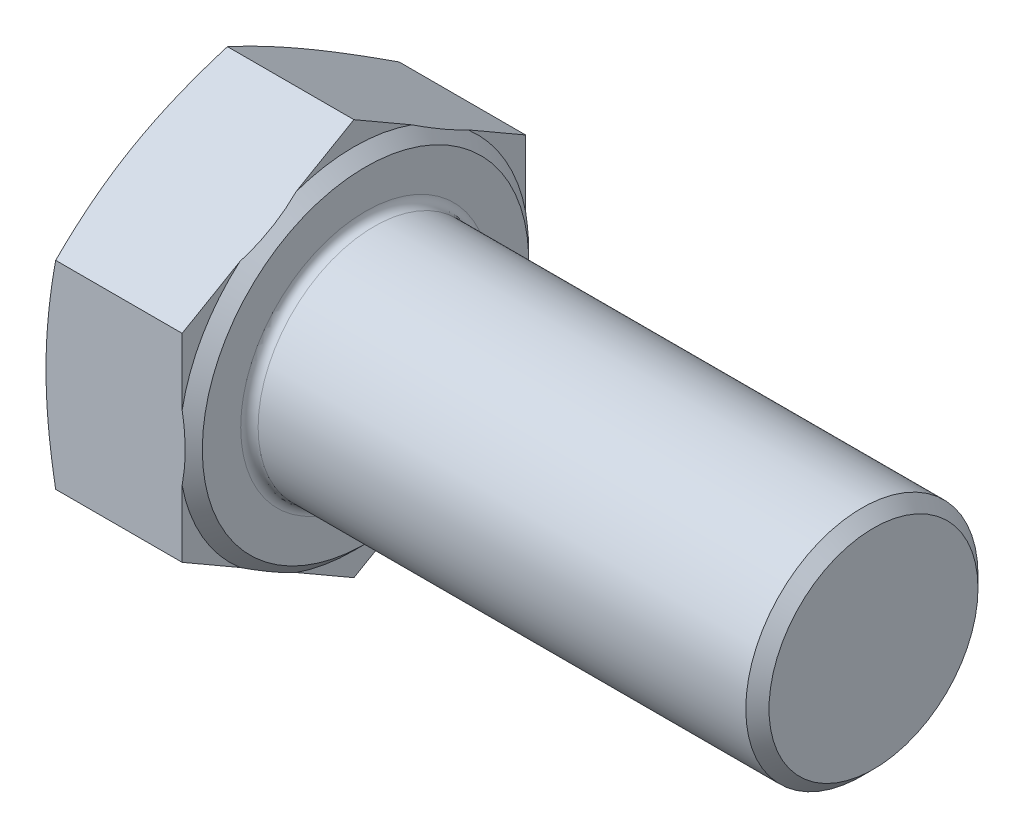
ISO-10303-21;
HEADER;
FILE_DESCRIPTION(('STEP AP214'),'2;1');
FILE_NAME('part.step','',(''),(''),'','','');
FILE_SCHEMA(('AUTOMOTIVE_DESIGN { 1 0 10303 214 1 1 1 1 }'));
ENDSEC;
DATA;
#1=APPLICATION_CONTEXT('core data for automotive mechanical design processes');
#2=APPLICATION_PROTOCOL_DEFINITION('international standard','automotive_design',2000,#1);
#3=PRODUCT_CONTEXT('',#1,'mechanical');
#4=PRODUCT('Part','Part','',(#3));
#5=PRODUCT_RELATED_PRODUCT_CATEGORY('part','',(#4));
#6=PRODUCT_DEFINITION_FORMATION('','',#4);
#7=PRODUCT_DEFINITION_CONTEXT('part definition',#1,'design');
#8=PRODUCT_DEFINITION('design','',#6,#7);
#9=PRODUCT_DEFINITION_SHAPE('','',#8);
#10=(LENGTH_UNIT() NAMED_UNIT(*) SI_UNIT(.MILLI.,.METRE.));
#11=(NAMED_UNIT(*) PLANE_ANGLE_UNIT() SI_UNIT($,.RADIAN.));
#12=(NAMED_UNIT(*) SI_UNIT($,.STERADIAN.) SOLID_ANGLE_UNIT());
#13=UNCERTAINTY_MEASURE_WITH_UNIT(LENGTH_MEASURE(1.E-05),#10,'distance_accuracy_value','');
#14=(GEOMETRIC_REPRESENTATION_CONTEXT(3) GLOBAL_UNCERTAINTY_ASSIGNED_CONTEXT((#13)) GLOBAL_UNIT_ASSIGNED_CONTEXT((#10,
#11,#12)) REPRESENTATION_CONTEXT('',''));
#15=CARTESIAN_POINT('',(0.,0.,0.));
#16=DIRECTION('',(0.,0.,1.));
#17=DIRECTION('',(1.,0.,0.));
#18=AXIS2_PLACEMENT_3D('',#15,#16,#17);
#19=CARTESIAN_POINT('',(10.18,-6.83294043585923,-11.835));
#20=DIRECTION('',(1.,0.,0.));
#21=DIRECTION('',(0.,0.,-1.));
#22=AXIS2_PLACEMENT_3D('',#19,#20,#21);
#23=PLANE('',#22);
#24=CARTESIAN_POINT('',(10.18,0.,0.));
#25=DIRECTION('',(1.,0.,0.));
#26=DIRECTION('',(0.,0.,-1.));
#27=AXIS2_PLACEMENT_3D('',#24,#25,#26);
#28=CIRCLE('',#27,8.6);
#29=CARTESIAN_POINT('',(10.18,0.,-8.6));
#30=VERTEX_POINT('',#29);
#31=EDGE_CURVE('E11',#30,#30,#28,.F.);
#32=ORIENTED_EDGE('',*,*,#31,.T.);
#33=EDGE_LOOP('',(#32));
#34=FACE_BOUND('',#33,.T.);
#35=CARTESIAN_POINT('',(10.18,0.,0.));
#36=DIRECTION('',(-1.,0.,0.));
#37=DIRECTION('',(0.,0.,1.));
#38=AXIS2_PLACEMENT_3D('',#35,#36,#37);
#39=CIRCLE('',#38,11.245);
#40=CARTESIAN_POINT('',(10.18,0.,11.245));
#41=VERTEX_POINT('',#40);
#42=EDGE_CURVE('E572',#41,#41,#39,.T.);
#43=ORIENTED_EDGE('',*,*,#42,.F.);
#44=EDGE_LOOP('',(#43));
#45=FACE_BOUND('',#44,.T.);
#46=ADVANCED_FACE('F34',(#34,#45),#23,.T.);
#47=CARTESIAN_POINT('',(10.18,-13.6658808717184,0.));
#48=DIRECTION('',(0.,0.866025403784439,0.5));
#49=DIRECTION('',(0.,-0.5,0.866025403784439));
#50=AXIS2_PLACEMENT_3D('',#47,#48,#49);
#51=PLANE('',#50);
#52=CARTESIAN_POINT('',(0.66642816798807,-6.83282496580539,-11.8352));
#53=CARTESIAN_POINT('',(0.563396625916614,-7.11580158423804,-11.3450701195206));
#54=CARTESIAN_POINT('',(0.469671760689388,-7.39971131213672,-10.8533240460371));
#55=CARTESIAN_POINT('',(0.304777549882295,-7.96937670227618,-9.86663464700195));
#56=CARTESIAN_POINT('',(0.233625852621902,-8.25513363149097,-9.37168912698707));
#57=CARTESIAN_POINT('',(0.118540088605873,-8.82532231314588,-8.38409336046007));
#58=CARTESIAN_POINT('',(0.0743550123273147,-9.10974104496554,-7.8914656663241));
#59=CARTESIAN_POINT('',(0.0150904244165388,-9.67924359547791,-6.90505831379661));
#60=CARTESIAN_POINT('',(0.,-9.96432712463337,-6.4112791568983));
#61=CARTESIAN_POINT('',(0.,-10.5344941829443,-5.42372084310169));
#62=CARTESIAN_POINT('',(0.015090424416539,-10.8195777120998,-4.92994168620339));
#63=CARTESIAN_POINT('',(0.0743550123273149,-11.3890802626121,-3.9435343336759));
#64=CARTESIAN_POINT('',(0.118540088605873,-11.6734989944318,-3.45090663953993));
#65=CARTESIAN_POINT('',(0.233625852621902,-12.2436876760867,-2.46331087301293));
#66=CARTESIAN_POINT('',(0.304777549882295,-12.5294446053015,-1.96836535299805));
#67=CARTESIAN_POINT('',(0.469671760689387,-13.099109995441,-0.981675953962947));
#68=CARTESIAN_POINT('',(0.563396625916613,-13.3830197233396,-0.489929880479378));
#69=CARTESIAN_POINT('',(0.66642816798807,-13.6659963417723,0.000200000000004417));
#70=B_SPLINE_CURVE_WITH_KNOTS('',3,(#52,#53,#54,#55,#56,#57,#58,#59,#60,#61,#62,#63,#64,#65,#66,
#67,#68,#69),.UNSPECIFIED.,.F.,.F.,(4,2,2,2,2,2,2,2,4),(0.,1.72594365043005,3.4532333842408,
5.16418975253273,6.87450425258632,8.5848187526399,10.2957751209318,12.0230648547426,
13.7490085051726),.UNSPECIFIED.);
#71=CARTESIAN_POINT('',(0.666386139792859,-6.83294043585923,-11.835));
#72=VERTEX_POINT('',#71);
#73=CARTESIAN_POINT('',(0.,-10.2494106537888,-5.9175));
#74=VERTEX_POINT('',#73);
#75=EDGE_CURVE('E149',#72,#74,#70,.T.);
#76=ORIENTED_EDGE('',*,*,#75,.F.);
#77=DIRECTION('',(-1.,0.,0.));
#78=VECTOR('',#77,1.);
#79=CARTESIAN_POINT('',(10.18,-6.83294043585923,-11.835));
#80=LINE('',#79,#78);
#81=CARTESIAN_POINT('',(9.38,-6.83294043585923,-11.835));
#82=VERTEX_POINT('',#81);
#83=EDGE_CURVE('E178',#82,#72,#80,.T.);
#84=ORIENTED_EDGE('',*,*,#83,.F.);
#85=DIRECTION('',(0.,0.5,-0.866025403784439));
#86=VECTOR('',#85,1.);
#87=CARTESIAN_POINT('',(9.38,-13.6658808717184,0.));
#88=LINE('',#87,#86);
#89=CARTESIAN_POINT('',(9.38,-9.12972319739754,-7.85685556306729));
#90=VERTEX_POINT('',#89);
#91=EDGE_CURVE('E313',#90,#82,#88,.T.);
#92=ORIENTED_EDGE('',*,*,#91,.F.);
#93=CARTESIAN_POINT('',(9.37979999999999,-11.3696358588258,-3.97721302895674));
#94=CARTESIAN_POINT('',(9.40725105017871,-11.2958534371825,-4.10500793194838));
#95=CARTESIAN_POINT('',(9.4321623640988,-11.2218391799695,-4.23320438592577));
#96=CARTESIAN_POINT('',(9.47671204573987,-11.0734087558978,-4.49029342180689));
#97=CARTESIAN_POINT('',(9.49634994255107,-10.9989925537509,-4.61918606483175));
#98=CARTESIAN_POINT('',(9.54706383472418,-10.7752213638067,-5.00676913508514));
#99=CARTESIAN_POINT('',(9.56992802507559,-10.6253756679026,-5.2663094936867));
#100=CARTESIAN_POINT('',(9.59267560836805,-10.327279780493,-5.7826267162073));
#101=CARTESIAN_POINT('',(9.59286377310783,-10.1790352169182,-6.03939383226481));
#102=CARTESIAN_POINT('',(9.57102297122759,-9.88301921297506,-6.55210859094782));
#103=CARTESIAN_POINT('',(9.54900529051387,-9.73524757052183,-6.80805658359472));
#104=CARTESIAN_POINT('',(9.49928064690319,-9.51135883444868,-7.1958432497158));
#105=CARTESIAN_POINT('',(9.47933678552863,-9.43478802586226,-7.32846778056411));
#106=CARTESIAN_POINT('',(9.43377810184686,-9.28178966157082,-7.59346872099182));
#107=CARTESIAN_POINT('',(9.40814331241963,-9.20536359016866,-7.72584255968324));
#108=CARTESIAN_POINT('',(9.3798,-9.12918544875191,-7.85778697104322));
#109=B_SPLINE_CURVE_WITH_KNOTS('',3,(#93,#94,#95,#96,#97,#98,#99,#100,#101,#102,#103,#104,#105,
#106,#107,#108),.UNSPECIFIED.,.F.,.F.,(4,2,2,2,2,2,2,4),(0.,0.450246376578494,0.90053294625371,
1.80130024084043,2.68995961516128,3.57816756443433,4.04138253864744,4.50624917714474),.UNSPECIFIED.);
#110=CARTESIAN_POINT('',(9.38,-11.3690981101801,-3.97814443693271));
#111=VERTEX_POINT('',#110);
#112=EDGE_CURVE('E300',#111,#90,#109,.T.);
#113=ORIENTED_EDGE('',*,*,#112,.F.);
#114=CARTESIAN_POINT('',(9.38,-13.6658808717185,0.));
#115=VERTEX_POINT('',#114);
#116=EDGE_CURVE('E310',#115,#111,#88,.T.);
#117=ORIENTED_EDGE('',*,*,#116,.F.);
#118=DIRECTION('',(-1.,0.,0.));
#119=VECTOR('',#118,1.);
#120=CARTESIAN_POINT('',(10.18,-13.6658808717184,0.));
#121=LINE('',#120,#119);
#122=CARTESIAN_POINT('',(0.666386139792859,-13.6658808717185,0.));
#123=VERTEX_POINT('',#122);
#124=EDGE_CURVE('E172',#115,#123,#121,.T.);
#125=ORIENTED_EDGE('',*,*,#124,.T.);
#126=EDGE_CURVE('E269',#74,#123,#70,.T.);
#127=ORIENTED_EDGE('',*,*,#126,.F.);
#128=EDGE_LOOP('',(#76,#84,#92,#113,#117,#125,#127));
#129=FACE_BOUND('',#128,.T.);
#130=ADVANCED_FACE('F36',(#129),#51,.F.);
#131=CARTESIAN_POINT('',(10.18,-6.83294043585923,-11.835));
#132=DIRECTION('',(0.,0.,1.));
#133=DIRECTION('',(0.,-1.,0.));
#134=AXIS2_PLACEMENT_3D('',#131,#132,#133);
#135=PLANE('',#134);
#136=CARTESIAN_POINT('',(3.56090389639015,-18.0912257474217,-11.835));
#137=CARTESIAN_POINT('',(3.39785704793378,-17.5557674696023,-11.835));
#138=CARTESIAN_POINT('',(3.23671274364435,-17.0197190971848,-11.835));
#139=CARTESIAN_POINT('',(2.91928170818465,-15.9461417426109,-11.835));
#140=CARTESIAN_POINT('',(2.76299536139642,-15.4086126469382,-11.835));
#141=CARTESIAN_POINT('',(2.456072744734,-14.3308533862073,-11.835));
#142=CARTESIAN_POINT('',(2.30544756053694,-13.7906200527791,-11.835));
#143=CARTESIAN_POINT('',(2.01161067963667,-12.7081437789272,-11.835));
#144=CARTESIAN_POINT('',(1.86839884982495,-12.1659008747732,-11.835));
#145=CARTESIAN_POINT('',(1.59293338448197,-11.085744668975,-11.835));
#146=CARTESIAN_POINT('',(1.46056641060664,-10.5478604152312,-11.835));
#147=CARTESIAN_POINT('',(1.20710192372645,-9.46941532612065,-11.835));
#148=CARTESIAN_POINT('',(1.08600460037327,-8.92885444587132,-11.835));
#149=CARTESIAN_POINT('',(0.857902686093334,-7.84493514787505,-11.835));
#150=CARTESIAN_POINT('',(0.750893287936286,-7.30157775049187,-11.835));
#151=CARTESIAN_POINT('',(0.554225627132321,-6.21170838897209,-11.835));
#152=CARTESIAN_POINT('',(0.464566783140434,-5.66519653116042,-11.835));
#153=CARTESIAN_POINT('',(0.315120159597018,-4.63055772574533,-11.835));
#154=CARTESIAN_POINT('',(0.253110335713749,-4.14275475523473,-11.835));
#155=CARTESIAN_POINT('',(0.148142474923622,-3.16508614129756,-11.835));
#156=CARTESIAN_POINT('',(0.105183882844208,-2.67522055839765,-11.835));
#157=CARTESIAN_POINT('',(0.0403872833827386,-1.69442034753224,-11.835));
#158=CARTESIAN_POINT('',(0.0185343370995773,-1.20348672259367,-11.835));
#159=CARTESIAN_POINT('',(-0.00294456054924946,-0.221128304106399,-11.835));
#160=CARTESIAN_POINT('',(-0.00257066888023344,0.2702964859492,-11.835));
#161=CARTESIAN_POINT('',(0.0204420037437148,1.25510943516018,-11.835));
#162=CARTESIAN_POINT('',(0.0431936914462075,1.74849491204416,-11.835));
#163=CARTESIAN_POINT('',(0.109914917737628,2.73381666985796,-11.835));
#164=CARTESIAN_POINT('',(0.15388496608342,3.2257529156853,-11.835));
#165=CARTESIAN_POINT('',(0.260986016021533,4.20793330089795,-11.835));
#166=CARTESIAN_POINT('',(0.324133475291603,4.69817561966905,-11.835));
#167=CARTESIAN_POINT('',(0.467027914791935,5.67620769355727,-11.835));
#168=CARTESIAN_POINT('',(0.54677498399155,6.16399743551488,-11.835));
#169=CARTESIAN_POINT('',(0.724862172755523,7.16279284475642,-11.835));
#170=CARTESIAN_POINT('',(0.82396265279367,7.67366172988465,-11.835));
#171=CARTESIAN_POINT('',(1.03491843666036,8.6927760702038,-11.835));
#172=CARTESIAN_POINT('',(1.1467747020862,9.20102132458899,-11.835));
#173=CARTESIAN_POINT('',(1.38089329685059,10.215250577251,-11.835));
#174=CARTESIAN_POINT('',(1.50315864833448,10.7212338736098,-11.835));
#175=CARTESIAN_POINT('',(1.75610654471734,11.7310689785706,-11.835));
#176=CARTESIAN_POINT('',(1.88678888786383,12.2349208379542,-11.835));
#177=CARTESIAN_POINT('',(2.15516955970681,13.2414389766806,-11.835));
#178=CARTESIAN_POINT('',(2.29287668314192,13.7441029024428,-11.835));
#179=CARTESIAN_POINT('',(2.57389303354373,14.7478602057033,-11.835));
#180=CARTESIAN_POINT('',(2.71720228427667,15.248953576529,-11.835));
#181=CARTESIAN_POINT('',(3.00839543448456,16.2497129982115,-11.835));
#182=CARTESIAN_POINT('',(3.15627854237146,16.7493792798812,-11.835));
#183=CARTESIAN_POINT('',(3.45585481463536,17.7475696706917,-11.835));
#184=CARTESIAN_POINT('',(3.60754800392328,18.2460937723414,-11.835));
#185=CARTESIAN_POINT('',(4.06397197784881,19.7292047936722,-11.835));
#186=CARTESIAN_POINT('',(4.37329530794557,20.7123780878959,-11.835));
#187=CARTESIAN_POINT('',(5.00070758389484,22.6759614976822,-11.835));
#188=CARTESIAN_POINT('',(5.31879695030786,23.6563714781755,-11.835));
#189=CARTESIAN_POINT('',(5.96018460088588,25.6113638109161,-11.835));
#190=CARTESIAN_POINT('',(6.2834585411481,26.5859541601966,-11.835));
#191=CARTESIAN_POINT('',(6.77195551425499,28.04659354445,-11.835));
#192=CARTESIAN_POINT('',(6.93537886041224,28.533246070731,-11.835));
#193=CARTESIAN_POINT('',(7.26328301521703,29.5061934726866,-11.835));
#194=CARTESIAN_POINT('',(7.42776382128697,29.9924883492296,-11.835));
#195=CARTESIAN_POINT('',(7.59270272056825,30.4786278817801,-11.835));
#196=B_SPLINE_CURVE_WITH_KNOTS('',3,(#136,#137,#138,#139,#140,#141,#142,#143,#144,#145,#146,
#147,#148,#149,#150,#151,#152,#153,#154,#155,#156,#157,#158,#159,#160,#161,#162,#163,#164,#165,
#166,#167,#168,#169,#170,#171,#172,#173,#174,#175,#176,#177,#178,#179,#180,#181,#182,#183,#184,
#185,#186,#187,#188,#189,#190,#191,#192,#193,#194,#195),.UNSPECIFIED.,.F.,.F.,(4,2,2,2,2,2,2,2,
2,2,2,2,2,2,2,2,2,2,2,2,2,2,2,2,2,2,2,2,2,4),(0.,1.67920770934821,3.35854794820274,
5.04102141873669,6.72346466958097,8.38516426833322,10.0468918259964,11.7080508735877,
13.3691542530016,14.8440160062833,16.3188347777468,17.792608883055,19.2663725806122,
20.7476104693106,22.2288839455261,23.711432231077,25.1939884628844,26.7549650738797,
28.3160594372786,29.8776086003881,31.4391203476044,33.0026374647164,34.5661612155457,
36.1294158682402,37.6926807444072,40.784667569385,43.8768029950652,46.9572058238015,
48.4972831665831,50.0373567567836),.UNSPECIFIED.);
#197=CARTESIAN_POINT('',(0.666386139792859,6.83294043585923,-11.835));
#198=VERTEX_POINT('',#197);
#199=CARTESIAN_POINT('',(0.,0.,-11.835));
#200=VERTEX_POINT('',#199);
#201=EDGE_CURVE('E280',#198,#200,#196,.F.);
#202=ORIENTED_EDGE('',*,*,#201,.F.);
#203=DIRECTION('',(-1.,0.,0.));
#204=VECTOR('',#203,1.);
#205=CARTESIAN_POINT('',(10.18,6.83294043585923,-11.835));
#206=LINE('',#205,#204);
#207=CARTESIAN_POINT('',(9.38,6.83294043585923,-11.835));
#208=VERTEX_POINT('',#207);
#209=EDGE_CURVE('E169',#208,#198,#206,.T.);
#210=ORIENTED_EDGE('',*,*,#209,.F.);
#211=DIRECTION('',(0.,1.,0.));
#212=VECTOR('',#211,1.);
#213=CARTESIAN_POINT('',(9.38,-6.83294043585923,-11.835));
#214=LINE('',#213,#212);
#215=CARTESIAN_POINT('',(9.38,2.23937491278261,-11.835));
#216=VERTEX_POINT('',#215);
#217=EDGE_CURVE('E321',#216,#208,#214,.T.);
#218=ORIENTED_EDGE('',*,*,#217,.F.);
#219=CARTESIAN_POINT('',(7.95124378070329,-6.44009950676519,-11.835));
#220=CARTESIAN_POINT('',(8.04175289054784,-6.25072246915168,-11.835));
#221=CARTESIAN_POINT('',(8.1297661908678,-6.06015624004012,-11.835));
#222=CARTESIAN_POINT('',(8.30021118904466,-5.67648277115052,-11.835));
#223=CARTESIAN_POINT('',(8.38264130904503,-5.48337483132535,-11.835));
#224=CARTESIAN_POINT('',(8.62105383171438,-4.89903518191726,-11.835));
#225=CARTESIAN_POINT('',(8.76762958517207,-4.50387775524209,-11.835));
#226=CARTESIAN_POINT('',(9.02902684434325,-3.70594144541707,-11.835));
#227=CARTESIAN_POINT('',(9.14404896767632,-3.30322897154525,-11.835));
#228=CARTESIAN_POINT('',(9.33744874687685,-2.48943923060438,-11.835));
#229=CARTESIAN_POINT('',(9.41587417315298,-2.07837360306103,-11.835));
#230=CARTESIAN_POINT('',(9.51435095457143,-1.37139596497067,-11.835));
#231=CARTESIAN_POINT('',(9.54476060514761,-1.07690752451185,-11.835));
#232=CARTESIAN_POINT('',(9.5836693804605,-0.486417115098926,-11.835));
#233=CARTESIAN_POINT('',(9.59216591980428,-0.190414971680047,-11.835));
#234=CARTESIAN_POINT('',(9.58689243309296,0.401551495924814,-11.835));
#235=CARTESIAN_POINT('',(9.57310960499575,0.697515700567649,-11.835));
#236=CARTESIAN_POINT('',(9.52379557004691,1.28758222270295,-11.835));
#237=CARTESIAN_POINT('',(9.48826700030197,1.58168476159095,-11.835));
#238=CARTESIAN_POINT('',(9.40831996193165,2.09287067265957,-11.835));
#239=CARTESIAN_POINT('',(9.36840235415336,2.31067448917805,-11.835));
#240=CARTESIAN_POINT('',(9.27789377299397,2.74406399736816,-11.835));
#241=CARTESIAN_POINT('',(9.22730163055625,2.95964944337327,-11.835));
#242=CARTESIAN_POINT('',(9.06061628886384,3.60311853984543,-11.835));
#243=CARTESIAN_POINT('',(8.92969755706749,4.02720401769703,-11.835));
#244=CARTESIAN_POINT('',(8.63486820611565,4.86573086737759,-11.835));
#245=CARTESIAN_POINT('',(8.4708066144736,5.2801180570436,-11.835));
#246=CARTESIAN_POINT('',(8.2055393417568,5.89241516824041,-11.835));
#247=CARTESIAN_POINT('',(8.11409115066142,6.09463413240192,-11.835));
#248=CARTESIAN_POINT('',(7.92545117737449,6.49630469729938,-11.835));
#249=CARTESIAN_POINT('',(7.82826112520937,6.69575710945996,-11.835));
#250=CARTESIAN_POINT('',(7.72852417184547,6.8939266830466,-11.835));
#251=B_SPLINE_CURVE_WITH_KNOTS('',3,(#219,#220,#221,#222,#223,#224,#225,#226,#227,#228,#229,
#230,#231,#232,#233,#234,#235,#236,#237,#238,#239,#240,#241,#242,#243,#244,#245,#246,#247,#248,
#249,#250),.UNSPECIFIED.,.F.,.F.,(4,2,2,2,2,2,2,2,2,2,2,2,2,2,2,4),(0.,0.629647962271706,
1.25947313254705,2.52275224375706,3.77780277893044,5.03121045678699,5.91862985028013,
6.80615394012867,7.69418819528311,8.58211477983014,9.24613809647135,9.91023417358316,
11.2399730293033,12.5759115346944,13.2416422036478,13.9071733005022),.UNSPECIFIED.);
#252=CARTESIAN_POINT('',(9.38,-2.23937491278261,-11.835));
#253=VERTEX_POINT('',#252);
#254=EDGE_CURVE('E294',#253,#216,#251,.T.);
#255=ORIENTED_EDGE('',*,*,#254,.F.);
#256=EDGE_CURVE('E322',#82,#253,#214,.T.);
#257=ORIENTED_EDGE('',*,*,#256,.F.);
#258=ORIENTED_EDGE('',*,*,#83,.T.);
#259=EDGE_CURVE('E160',#200,#72,#196,.F.);
#260=ORIENTED_EDGE('',*,*,#259,.F.);
#261=EDGE_LOOP('',(#202,#210,#218,#255,#257,#258,#260));
#262=FACE_BOUND('',#261,.T.);
#263=ADVANCED_FACE('F218',(#262),#135,.F.);
#264=CARTESIAN_POINT('',(10.18,6.83294043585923,-11.835));
#265=DIRECTION('',(0.,-0.866025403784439,0.5));
#266=DIRECTION('',(0.,-0.5,-0.866025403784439));
#267=AXIS2_PLACEMENT_3D('',#264,#265,#266);
#268=PLANE('',#267);
#269=CARTESIAN_POINT('',(0.666428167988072,13.6659963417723,0.000199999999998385));
#270=CARTESIAN_POINT('',(0.563396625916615,13.3830197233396,-0.489929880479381));
#271=CARTESIAN_POINT('',(0.469671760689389,13.099109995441,-0.98167595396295));
#272=CARTESIAN_POINT('',(0.304777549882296,12.5294446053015,-1.96836535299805));
#273=CARTESIAN_POINT('',(0.233625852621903,12.2436876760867,-2.46331087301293));
#274=CARTESIAN_POINT('',(0.118540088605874,11.6734989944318,-3.45090663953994));
#275=CARTESIAN_POINT('',(0.0743550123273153,11.3890802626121,-3.9435343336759));
#276=CARTESIAN_POINT('',(0.0150904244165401,10.8195777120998,-4.92994168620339));
#277=CARTESIAN_POINT('',(0.,10.5344941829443,-5.4237208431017));
#278=CARTESIAN_POINT('',(0.,9.96432712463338,-6.41127915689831));
#279=CARTESIAN_POINT('',(0.0150904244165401,9.67924359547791,-6.90505831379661));
#280=CARTESIAN_POINT('',(0.0743550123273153,9.10974104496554,-7.8914656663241));
#281=CARTESIAN_POINT('',(0.118540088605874,8.82532231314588,-8.38409336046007));
#282=CARTESIAN_POINT('',(0.233625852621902,8.25513363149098,-9.37168912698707));
#283=CARTESIAN_POINT('',(0.304777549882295,7.96937670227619,-9.86663464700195));
#284=CARTESIAN_POINT('',(0.469671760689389,7.39971131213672,-10.8533240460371));
#285=CARTESIAN_POINT('',(0.563396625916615,7.11580158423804,-11.3450701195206));
#286=CARTESIAN_POINT('',(0.666428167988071,6.83282496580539,-11.8352));
#287=B_SPLINE_CURVE_WITH_KNOTS('',3,(#269,#270,#271,#272,#273,#274,#275,#276,#277,#278,#279,
#280,#281,#282,#283,#284,#285,#286),.UNSPECIFIED.,.F.,.F.,(4,2,2,2,2,2,2,2,4),(0.,
1.72594365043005,3.4532333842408,5.16418975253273,6.87450425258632,8.5848187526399,
10.2957751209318,12.0230648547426,13.7490085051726),.UNSPECIFIED.);
#288=CARTESIAN_POINT('',(0.666386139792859,13.6658808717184,0.));
#289=VERTEX_POINT('',#288);
#290=CARTESIAN_POINT('',(0.,10.2494106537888,-5.9175));
#291=VERTEX_POINT('',#290);
#292=EDGE_CURVE('E50',#289,#291,#287,.T.);
#293=ORIENTED_EDGE('',*,*,#292,.F.);
#294=DIRECTION('',(-1.,0.,0.));
#295=VECTOR('',#294,1.);
#296=CARTESIAN_POINT('',(10.18,13.6658808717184,0.));
#297=LINE('',#296,#295);
#298=CARTESIAN_POINT('',(9.38,13.6658808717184,0.));
#299=VERTEX_POINT('',#298);
#300=EDGE_CURVE('E166',#299,#289,#297,.T.);
#301=ORIENTED_EDGE('',*,*,#300,.F.);
#302=DIRECTION('',(0.,0.5,0.866025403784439));
#303=VECTOR('',#302,1.);
#304=CARTESIAN_POINT('',(9.38,6.83294043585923,-11.835));
#305=LINE('',#304,#303);
#306=CARTESIAN_POINT('',(9.38,11.3690981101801,-3.97814443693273));
#307=VERTEX_POINT('',#306);
#308=EDGE_CURVE('E318',#307,#299,#305,.T.);
#309=ORIENTED_EDGE('',*,*,#308,.F.);
#310=CARTESIAN_POINT('',(9.3798,9.12918544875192,-7.85778697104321));
#311=CARTESIAN_POINT('',(9.40725105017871,9.20296787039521,-7.72999206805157));
#312=CARTESIAN_POINT('',(9.43216236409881,9.27698212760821,-7.60179561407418));
#313=CARTESIAN_POINT('',(9.47671204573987,9.42541255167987,-7.34470657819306));
#314=CARTESIAN_POINT('',(9.49634994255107,9.49982875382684,-7.2158139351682));
#315=CARTESIAN_POINT('',(9.54706383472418,9.72359994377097,-6.82823086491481));
#316=CARTESIAN_POINT('',(9.56992802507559,9.87344563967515,-6.56869050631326));
#317=CARTESIAN_POINT('',(9.59267560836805,10.1715415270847,-6.05237328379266));
#318=CARTESIAN_POINT('',(9.59286377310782,10.3197860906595,-5.79560616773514));
#319=CARTESIAN_POINT('',(9.57102297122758,10.6158020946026,-5.28289140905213));
#320=CARTESIAN_POINT('',(9.54900529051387,10.7635737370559,-5.02694341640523));
#321=CARTESIAN_POINT('',(9.49928064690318,10.987462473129,-4.63915675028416));
#322=CARTESIAN_POINT('',(9.47933678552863,11.0640332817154,-4.50653221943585));
#323=CARTESIAN_POINT('',(9.43377810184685,11.2170316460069,-4.24153127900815));
#324=CARTESIAN_POINT('',(9.40814331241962,11.293457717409,-4.10915744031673));
#325=CARTESIAN_POINT('',(9.37979999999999,11.3696358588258,-3.97721302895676));
#326=B_SPLINE_CURVE_WITH_KNOTS('',3,(#310,#311,#312,#313,#314,#315,#316,#317,#318,#319,#320,
#321,#322,#323,#324,#325),.UNSPECIFIED.,.F.,.F.,(4,2,2,2,2,2,2,4),(0.,0.450246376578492,
0.900532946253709,1.80130024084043,2.68995961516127,3.57816756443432,4.04138253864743,
4.50624917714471),.UNSPECIFIED.);
#327=CARTESIAN_POINT('',(9.38,9.12972319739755,-7.85685556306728));
#328=VERTEX_POINT('',#327);
#329=EDGE_CURVE('E301',#328,#307,#326,.T.);
#330=ORIENTED_EDGE('',*,*,#329,.F.);
#331=EDGE_CURVE('E320',#208,#328,#305,.T.);
#332=ORIENTED_EDGE('',*,*,#331,.F.);
#333=ORIENTED_EDGE('',*,*,#209,.T.);
#334=EDGE_CURVE('E281',#291,#198,#287,.T.);
#335=ORIENTED_EDGE('',*,*,#334,.F.);
#336=EDGE_LOOP('',(#293,#301,#309,#330,#332,#333,#335));
#337=FACE_BOUND('',#336,.T.);
#338=ADVANCED_FACE('F289',(#337),#268,.F.);
#339=CARTESIAN_POINT('',(10.18,13.6658808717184,0.));
#340=DIRECTION('',(0.,-0.866025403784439,-0.5));
#341=DIRECTION('',(0.,0.5,-0.866025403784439));
#342=AXIS2_PLACEMENT_3D('',#339,#340,#341);
#343=PLANE('',#342);
#344=CARTESIAN_POINT('',(0.66642816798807,6.83282496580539,11.8352));
#345=CARTESIAN_POINT('',(0.563396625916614,7.11580158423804,11.3450701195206));
#346=CARTESIAN_POINT('',(0.469671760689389,7.39971131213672,10.8533240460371));
#347=CARTESIAN_POINT('',(0.304777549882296,7.96937670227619,9.86663464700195));
#348=CARTESIAN_POINT('',(0.233625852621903,8.25513363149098,9.37168912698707));
#349=CARTESIAN_POINT('',(0.118540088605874,8.82532231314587,8.38409336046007));
#350=CARTESIAN_POINT('',(0.0743550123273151,9.10974104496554,7.8914656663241));
#351=CARTESIAN_POINT('',(0.0150904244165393,9.67924359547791,6.90505831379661));
#352=CARTESIAN_POINT('',(0.,9.96432712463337,6.41127915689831));
#353=CARTESIAN_POINT('',(0.,10.5344941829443,5.4237208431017));
#354=CARTESIAN_POINT('',(0.0150904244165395,10.8195777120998,4.92994168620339));
#355=CARTESIAN_POINT('',(0.0743550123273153,11.3890802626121,3.9435343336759));
#356=CARTESIAN_POINT('',(0.118540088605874,11.6734989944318,3.45090663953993));
#357=CARTESIAN_POINT('',(0.233625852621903,12.2436876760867,2.46331087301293));
#358=CARTESIAN_POINT('',(0.304777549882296,12.5294446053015,1.96836535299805));
#359=CARTESIAN_POINT('',(0.469671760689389,13.099109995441,0.981675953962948));
#360=CARTESIAN_POINT('',(0.563396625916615,13.3830197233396,0.489929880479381));
#361=CARTESIAN_POINT('',(0.666428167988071,13.6659963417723,-0.000200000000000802));
#362=B_SPLINE_CURVE_WITH_KNOTS('',3,(#344,#345,#346,#347,#348,#349,#350,#351,#352,#353,#354,
#355,#356,#357,#358,#359,#360,#361),.UNSPECIFIED.,.F.,.F.,(4,2,2,2,2,2,2,2,4),(0.,
1.72594365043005,3.4532333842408,5.16418975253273,6.87450425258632,8.5848187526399,
10.2957751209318,12.0230648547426,13.7490085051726),.UNSPECIFIED.);
#363=CARTESIAN_POINT('',(0.666386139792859,6.83294043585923,11.835));
#364=VERTEX_POINT('',#363);
#365=CARTESIAN_POINT('',(0.,10.2494106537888,5.9175));
#366=VERTEX_POINT('',#365);
#367=EDGE_CURVE('E58',#364,#366,#362,.T.);
#368=ORIENTED_EDGE('',*,*,#367,.F.);
#369=DIRECTION('',(-1.,0.,0.));
#370=VECTOR('',#369,1.);
#371=CARTESIAN_POINT('',(10.18,6.83294043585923,11.835));
#372=LINE('',#371,#370);
#373=CARTESIAN_POINT('',(9.38,6.83294043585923,11.835));
#374=VERTEX_POINT('',#373);
#375=EDGE_CURVE('E157',#374,#364,#372,.T.);
#376=ORIENTED_EDGE('',*,*,#375,.F.);
#377=DIRECTION('',(0.,-0.5,0.866025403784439));
#378=VECTOR('',#377,1.);
#379=CARTESIAN_POINT('',(9.38,13.6658808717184,0.));
#380=LINE('',#379,#378);
#381=CARTESIAN_POINT('',(9.38,9.12972319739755,7.85685556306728));
#382=VERTEX_POINT('',#381);
#383=EDGE_CURVE('E315',#382,#374,#380,.T.);
#384=ORIENTED_EDGE('',*,*,#383,.F.);
#385=CARTESIAN_POINT('',(9.3798,11.3696358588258,3.97721302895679));
#386=CARTESIAN_POINT('',(9.40725105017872,11.2958534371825,4.10500793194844));
#387=CARTESIAN_POINT('',(9.43216236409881,11.2218391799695,4.23320438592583));
#388=CARTESIAN_POINT('',(9.47671204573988,11.0734087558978,4.49029342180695));
#389=CARTESIAN_POINT('',(9.49634994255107,10.9989925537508,4.61918606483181));
#390=CARTESIAN_POINT('',(9.54706383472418,10.7752213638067,5.00676913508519));
#391=CARTESIAN_POINT('',(9.56992802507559,10.6253756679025,5.26630949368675));
#392=CARTESIAN_POINT('',(9.59267560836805,10.327279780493,5.78262671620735));
#393=CARTESIAN_POINT('',(9.59286377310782,10.1790352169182,6.03939383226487));
#394=CARTESIAN_POINT('',(9.57102297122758,9.88301921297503,6.55210859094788));
#395=CARTESIAN_POINT('',(9.54900529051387,9.7352475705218,6.80805658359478));
#396=CARTESIAN_POINT('',(9.49928064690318,9.51135883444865,7.19584324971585));
#397=CARTESIAN_POINT('',(9.47933678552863,9.43478802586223,7.32846778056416));
#398=CARTESIAN_POINT('',(9.43377810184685,9.2817896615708,7.59346872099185));
#399=CARTESIAN_POINT('',(9.40814331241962,9.20536359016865,7.72584255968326));
#400=CARTESIAN_POINT('',(9.3798,9.1291854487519,7.85778697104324));
#401=B_SPLINE_CURVE_WITH_KNOTS('',3,(#385,#386,#387,#388,#389,#390,#391,#392,#393,#394,#395,
#396,#397,#398,#399,#400),.UNSPECIFIED.,.F.,.F.,(4,2,2,2,2,2,2,4),(0.,0.450246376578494,
0.90053294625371,1.80130024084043,2.68995961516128,3.57816756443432,4.04138253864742,
4.5062491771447),.UNSPECIFIED.);
#402=CARTESIAN_POINT('',(9.38,11.3690981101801,3.97814443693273));
#403=VERTEX_POINT('',#402);
#404=EDGE_CURVE('E355',#403,#382,#401,.T.);
#405=ORIENTED_EDGE('',*,*,#404,.F.);
#406=EDGE_CURVE('E317',#299,#403,#380,.T.);
#407=ORIENTED_EDGE('',*,*,#406,.F.);
#408=ORIENTED_EDGE('',*,*,#300,.T.);
#409=EDGE_CURVE('E159',#366,#289,#362,.T.);
#410=ORIENTED_EDGE('',*,*,#409,.F.);
#411=EDGE_LOOP('',(#368,#376,#384,#405,#407,#408,#410));
#412=FACE_BOUND('',#411,.T.);
#413=ADVANCED_FACE('F155',(#412),#343,.F.);
#414=CARTESIAN_POINT('',(10.18,6.83294043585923,11.835));
#415=DIRECTION('',(0.,0.,-1.));
#416=DIRECTION('',(-1.,0.,0.));
#417=AXIS2_PLACEMENT_3D('',#414,#415,#416);
#418=PLANE('',#417);
#419=CARTESIAN_POINT('',(3.5609032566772,-18.0912236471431,11.835));
#420=CARTESIAN_POINT('',(3.39785643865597,-17.5557654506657,11.835));
#421=CARTESIAN_POINT('',(3.23671216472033,-17.0197171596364,11.835));
#422=CARTESIAN_POINT('',(2.91928118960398,-15.9461399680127,11.835));
#423=CARTESIAN_POINT('',(2.76299487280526,-15.408610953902,11.835));
#424=CARTESIAN_POINT('',(2.45607231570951,-14.3308518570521,11.835));
#425=CARTESIAN_POINT('',(2.30544716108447,-13.7906186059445,11.835));
#426=CARTESIAN_POINT('',(2.01161033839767,-12.708142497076,11.835));
#427=CARTESIAN_POINT('',(1.86839853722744,-12.1658996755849,11.835));
#428=CARTESIAN_POINT('',(1.59293312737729,-11.0857436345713,11.835));
#429=CARTESIAN_POINT('',(1.4605661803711,-10.5478594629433,11.835));
#430=CARTESIAN_POINT('',(1.20710174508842,-9.46941453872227,11.835));
#431=CARTESIAN_POINT('',(1.08600444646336,-8.92885374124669,11.835));
#432=CARTESIAN_POINT('',(0.857902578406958,-7.8449346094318,11.835));
#433=CARTESIAN_POINT('',(0.750893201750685,-7.30157729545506,11.835));
#434=CARTESIAN_POINT('',(0.554225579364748,-6.21170810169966,11.835));
#435=CARTESIAN_POINT('',(0.464566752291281,-5.66519632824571,11.835));
#436=CARTESIAN_POINT('',(0.315120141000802,-4.63055758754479,11.835));
#437=CARTESIAN_POINT('',(0.253110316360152,-4.14275459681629,11.835));
#438=CARTESIAN_POINT('',(0.148142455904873,-3.1650859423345,11.835));
#439=CARTESIAN_POINT('',(0.105183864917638,-2.67522033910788,11.835));
#440=CARTESIAN_POINT('',(0.0403872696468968,-1.69442008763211,11.835));
#441=CARTESIAN_POINT('',(0.0185343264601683,-1.20348644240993,11.835));
#442=CARTESIAN_POINT('',(-0.00294456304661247,-0.221127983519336,11.835));
#443=CARTESIAN_POINT('',(-0.00257066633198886,0.270296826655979,11.835));
#444=CARTESIAN_POINT('',(0.0204420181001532,1.25510981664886,11.835));
#445=CARTESIAN_POINT('',(0.0431937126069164,1.74849531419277,11.835));
#446=CARTESIAN_POINT('',(0.109914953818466,2.73381711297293,11.835));
#447=CARTESIAN_POINT('',(0.153885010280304,3.22575337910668,11.835));
#448=CARTESIAN_POINT('',(0.260986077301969,4.20793380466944,11.835));
#449=CARTESIAN_POINT('',(0.324133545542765,4.69817614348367,11.835));
#450=CARTESIAN_POINT('',(0.467028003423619,5.6762082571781,11.835));
#451=CARTESIAN_POINT('',(0.546775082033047,6.16399801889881,11.835));
#452=CARTESIAN_POINT('',(0.724862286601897,7.16279344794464,11.835));
#453=CARTESIAN_POINT('',(0.823962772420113,7.6736623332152,11.835));
#454=CARTESIAN_POINT('',(1.03491856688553,8.69277667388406,11.835));
#455=CARTESIAN_POINT('',(1.1467748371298,9.20102192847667,11.835));
#456=CARTESIAN_POINT('',(1.3808934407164,10.2152511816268,11.835));
#457=CARTESIAN_POINT('',(1.5031587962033,10.7212344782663,11.835));
#458=CARTESIAN_POINT('',(1.7561066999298,11.7310695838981,11.835));
#459=CARTESIAN_POINT('',(1.88678904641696,12.2349214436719,11.835));
#460=CARTESIAN_POINT('',(2.15516972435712,13.2414395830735,11.835));
#461=CARTESIAN_POINT('',(2.2928768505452,13.7441035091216,11.835));
#462=CARTESIAN_POINT('',(2.5738932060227,14.7478608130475,11.835));
#463=CARTESIAN_POINT('',(2.71720245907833,15.2489541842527,11.835));
#464=CARTESIAN_POINT('',(3.00839561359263,16.249713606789,11.835));
#465=CARTESIAN_POINT('',(3.15627872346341,16.7493798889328,11.835));
#466=CARTESIAN_POINT('',(3.45585499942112,17.7475702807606,11.835));
#467=CARTESIAN_POINT('',(3.60754819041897,18.2460943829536,11.835));
#468=CARTESIAN_POINT('',(4.06397216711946,19.7292053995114,11.835));
#469=CARTESIAN_POINT('',(4.3732954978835,20.7123786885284,11.835));
#470=CARTESIAN_POINT('',(5.00070777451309,22.6759620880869,11.835));
#471=CARTESIAN_POINT('',(5.31879714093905,23.6563720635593,11.835));
#472=CARTESIAN_POINT('',(5.96018479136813,25.6113643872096,11.835));
#473=CARTESIAN_POINT('',(6.28345873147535,26.5859547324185,11.835));
#474=CARTESIAN_POINT('',(6.77195570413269,28.0465941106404,11.835));
#475=CARTESIAN_POINT('',(6.93537905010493,28.5332466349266,11.835));
#476=CARTESIAN_POINT('',(7.26328320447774,29.5061940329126,11.835));
#477=CARTESIAN_POINT('',(7.42776401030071,29.9924889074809,11.835));
#478=CARTESIAN_POINT('',(7.59270290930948,30.4786284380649,11.835));
#479=B_SPLINE_CURVE_WITH_KNOTS('',3,(#419,#420,#421,#422,#423,#424,#425,#426,#427,#428,#429,
#430,#431,#432,#433,#434,#435,#436,#437,#438,#439,#440,#441,#442,#443,#444,#445,#446,#447,#448,
#449,#450,#451,#452,#453,#454,#455,#456,#457,#458,#459,#460,#461,#462,#463,#464,#465,#466,#467,
#468,#469,#470,#471,#472,#473,#474,#475,#476,#477,#478),.UNSPECIFIED.,.F.,.F.,(4,2,2,2,2,2,2,2,
2,2,2,2,2,2,2,2,2,2,2,2,2,2,2,2,2,2,2,2,2,4),(0.,1.679207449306,3.3585474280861,
5.04102063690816,6.72346362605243,8.38516296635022,10.0468902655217,11.7080490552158,
13.3691521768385,14.8440139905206,16.3188328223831,17.792606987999,19.2663707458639,
20.7476086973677,22.2288822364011,23.7114305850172,25.1939868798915,26.7549634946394,
28.3160578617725,29.8776070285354,31.43911877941,33.0026358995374,34.5661596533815,
36.1294143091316,37.6926791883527,40.7846659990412,43.8768014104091,46.9572042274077,
48.4972815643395,50.0373551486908),.UNSPECIFIED.);
#480=CARTESIAN_POINT('',(0.666386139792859,-6.83294043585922,11.835));
#481=VERTEX_POINT('',#480);
#482=CARTESIAN_POINT('',(0.,0.,11.835));
#483=VERTEX_POINT('',#482);
#484=EDGE_CURVE('E151',#481,#483,#479,.T.);
#485=ORIENTED_EDGE('',*,*,#484,.F.);
#486=DIRECTION('',(-1.,0.,0.));
#487=VECTOR('',#486,1.);
#488=CARTESIAN_POINT('',(10.18,-6.83294043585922,11.835));
#489=LINE('',#488,#487);
#490=CARTESIAN_POINT('',(9.38,-6.83294043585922,11.835));
#491=VERTEX_POINT('',#490);
#492=EDGE_CURVE('E167',#491,#481,#489,.T.);
#493=ORIENTED_EDGE('',*,*,#492,.F.);
#494=DIRECTION('',(0.,-1.,0.));
#495=VECTOR('',#494,1.);
#496=CARTESIAN_POINT('',(9.38,6.83294043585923,11.835));
#497=LINE('',#496,#495);
#498=CARTESIAN_POINT('',(9.38,-2.23937491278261,11.835));
#499=VERTEX_POINT('',#498);
#500=EDGE_CURVE('E312',#499,#491,#497,.T.);
#501=ORIENTED_EDGE('',*,*,#500,.F.);
#502=CARTESIAN_POINT('',(7.9512437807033,-6.44009950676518,11.835));
#503=CARTESIAN_POINT('',(8.04175289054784,-6.25072246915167,11.835));
#504=CARTESIAN_POINT('',(8.1297661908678,-6.06015624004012,11.835));
#505=CARTESIAN_POINT('',(8.30021118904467,-5.67648277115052,11.835));
#506=CARTESIAN_POINT('',(8.38264130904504,-5.48337483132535,11.835));
#507=CARTESIAN_POINT('',(8.62105383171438,-4.89903518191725,11.835));
#508=CARTESIAN_POINT('',(8.76762958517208,-4.50387775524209,11.835));
#509=CARTESIAN_POINT('',(9.02902684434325,-3.70594144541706,11.835));
#510=CARTESIAN_POINT('',(9.14404896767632,-3.30322897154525,11.835));
#511=CARTESIAN_POINT('',(9.33744874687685,-2.48943923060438,11.835));
#512=CARTESIAN_POINT('',(9.41587417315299,-2.07837360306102,11.835));
#513=CARTESIAN_POINT('',(9.51435095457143,-1.37139596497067,11.835));
#514=CARTESIAN_POINT('',(9.54476060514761,-1.07690752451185,11.835));
#515=CARTESIAN_POINT('',(9.5836693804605,-0.486417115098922,11.835));
#516=CARTESIAN_POINT('',(9.59216591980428,-0.190414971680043,11.835));
#517=CARTESIAN_POINT('',(9.58689243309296,0.401551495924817,11.835));
#518=CARTESIAN_POINT('',(9.57310960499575,0.697515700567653,11.835));
#519=CARTESIAN_POINT('',(9.5237955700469,1.28758222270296,11.835));
#520=CARTESIAN_POINT('',(9.48826700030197,1.58168476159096,11.835));
#521=CARTESIAN_POINT('',(9.40831996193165,2.09287067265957,11.835));
#522=CARTESIAN_POINT('',(9.36840235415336,2.31067448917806,11.835));
#523=CARTESIAN_POINT('',(9.27789377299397,2.74406399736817,11.835));
#524=CARTESIAN_POINT('',(9.22730163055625,2.95964944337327,11.835));
#525=CARTESIAN_POINT('',(9.06061628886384,3.60311853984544,11.835));
#526=CARTESIAN_POINT('',(8.92969755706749,4.02720401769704,11.835));
#527=CARTESIAN_POINT('',(8.63486820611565,4.86573086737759,11.835));
#528=CARTESIAN_POINT('',(8.4708066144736,5.28011805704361,11.835));
#529=CARTESIAN_POINT('',(8.2055393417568,5.89241516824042,11.835));
#530=CARTESIAN_POINT('',(8.11409115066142,6.09463413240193,11.835));
#531=CARTESIAN_POINT('',(7.92545117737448,6.49630469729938,11.835));
#532=CARTESIAN_POINT('',(7.82826112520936,6.69575710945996,11.835));
#533=CARTESIAN_POINT('',(7.72852417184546,6.89392668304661,11.835));
#534=B_SPLINE_CURVE_WITH_KNOTS('',3,(#502,#503,#504,#505,#506,#507,#508,#509,#510,#511,#512,
#513,#514,#515,#516,#517,#518,#519,#520,#521,#522,#523,#524,#525,#526,#527,#528,#529,#530,#531,
#532,#533),.UNSPECIFIED.,.F.,.F.,(4,2,2,2,2,2,2,2,2,2,2,2,2,2,2,4),(0.,0.629647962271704,
1.25947313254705,2.52275224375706,3.77780277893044,5.03121045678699,5.91862985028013,
6.80615394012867,7.69418819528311,8.58211477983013,9.24613809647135,9.91023417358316,
11.2399730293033,12.5759115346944,13.2416422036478,13.9071733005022),.UNSPECIFIED.);
#535=CARTESIAN_POINT('',(9.38,2.23937491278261,11.835));
#536=VERTEX_POINT('',#535);
#537=EDGE_CURVE('E356',#536,#499,#534,.F.);
#538=ORIENTED_EDGE('',*,*,#537,.F.);
#539=EDGE_CURVE('E165',#374,#536,#497,.T.);
#540=ORIENTED_EDGE('',*,*,#539,.F.);
#541=ORIENTED_EDGE('',*,*,#375,.T.);
#542=EDGE_CURVE('E141',#483,#364,#479,.T.);
#543=ORIENTED_EDGE('',*,*,#542,.F.);
#544=EDGE_LOOP('',(#485,#493,#501,#538,#540,#541,#543));
#545=FACE_BOUND('',#544,.T.);
#546=ADVANCED_FACE('F163',(#545),#418,.F.);
#547=CARTESIAN_POINT('',(10.18,-6.83294043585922,11.835));
#548=DIRECTION('',(0.,0.866025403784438,-0.5));
#549=DIRECTION('',(0.,0.5,0.866025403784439));
#550=AXIS2_PLACEMENT_3D('',#547,#548,#549);
#551=PLANE('',#550);
#552=CARTESIAN_POINT('',(0.66642816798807,-13.6659963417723,-0.000199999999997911));
#553=CARTESIAN_POINT('',(0.563396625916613,-13.3830197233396,0.489929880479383));
#554=CARTESIAN_POINT('',(0.469671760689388,-13.099109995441,0.981675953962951));
#555=CARTESIAN_POINT('',(0.304777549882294,-12.5294446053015,1.96836535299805));
#556=CARTESIAN_POINT('',(0.233625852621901,-12.2436876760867,2.46331087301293));
#557=CARTESIAN_POINT('',(0.118540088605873,-11.6734989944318,3.45090663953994));
#558=CARTESIAN_POINT('',(0.0743550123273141,-11.3890802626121,3.9435343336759));
#559=CARTESIAN_POINT('',(0.0150904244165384,-10.8195777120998,4.92994168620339));
#560=CARTESIAN_POINT('',(0.,-10.5344941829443,5.4237208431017));
#561=CARTESIAN_POINT('',(0.,-9.96432712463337,6.41127915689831));
#562=CARTESIAN_POINT('',(0.0150904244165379,-9.6792435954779,6.90505831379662));
#563=CARTESIAN_POINT('',(0.0743550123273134,-9.10974104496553,7.89146566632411));
#564=CARTESIAN_POINT('',(0.118540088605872,-8.82532231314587,8.38409336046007));
#565=CARTESIAN_POINT('',(0.233625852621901,-8.25513363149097,9.37168912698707));
#566=CARTESIAN_POINT('',(0.304777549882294,-7.96937670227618,9.86663464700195));
#567=CARTESIAN_POINT('',(0.469671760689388,-7.39971131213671,10.8533240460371));
#568=CARTESIAN_POINT('',(0.563396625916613,-7.11580158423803,11.3450701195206));
#569=CARTESIAN_POINT('',(0.666428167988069,-6.83282496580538,11.8352));
#570=B_SPLINE_CURVE_WITH_KNOTS('',3,(#552,#553,#554,#555,#556,#557,#558,#559,#560,#561,#562,
#563,#564,#565,#566,#567,#568,#569),.UNSPECIFIED.,.F.,.F.,(4,2,2,2,2,2,2,2,4),(0.,
1.72594365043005,3.4532333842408,5.16418975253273,6.87450425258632,8.5848187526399,
10.2957751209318,12.0230648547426,13.7490085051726),.UNSPECIFIED.);
#571=CARTESIAN_POINT('',(0.,-10.2494106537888,5.9175));
#572=VERTEX_POINT('',#571);
#573=EDGE_CURVE('E249',#123,#572,#570,.T.);
#574=ORIENTED_EDGE('',*,*,#573,.F.);
#575=ORIENTED_EDGE('',*,*,#124,.F.);
#576=DIRECTION('',(0.,-0.5,-0.866025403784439));
#577=VECTOR('',#576,1.);
#578=CARTESIAN_POINT('',(9.38,-6.83294043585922,11.835));
#579=LINE('',#578,#577);
#580=CARTESIAN_POINT('',(9.38,-11.3690981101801,3.97814443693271));
#581=VERTEX_POINT('',#580);
#582=EDGE_CURVE('E181',#581,#115,#579,.T.);
#583=ORIENTED_EDGE('',*,*,#582,.F.);
#584=CARTESIAN_POINT('',(9.37979999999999,-9.12918544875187,7.85778697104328));
#585=CARTESIAN_POINT('',(9.40725105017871,-9.20296787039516,7.72999206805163));
#586=CARTESIAN_POINT('',(9.4321623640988,-9.27698212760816,7.60179561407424));
#587=CARTESIAN_POINT('',(9.47671204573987,-9.42541255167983,7.34470657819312));
#588=CARTESIAN_POINT('',(9.49634994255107,-9.49982875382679,7.21581393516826));
#589=CARTESIAN_POINT('',(9.54706383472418,-9.72359994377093,6.82823086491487));
#590=CARTESIAN_POINT('',(9.56992802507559,-9.87344563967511,6.56869050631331));
#591=CARTESIAN_POINT('',(9.59267560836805,-10.1715415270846,6.05237328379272));
#592=CARTESIAN_POINT('',(9.59286377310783,-10.3197860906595,5.7956061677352));
#593=CARTESIAN_POINT('',(9.57102297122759,-10.6158020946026,5.28289140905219));
#594=CARTESIAN_POINT('',(9.54900529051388,-10.7635737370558,5.02694341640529));
#595=CARTESIAN_POINT('',(9.4992806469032,-10.987462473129,4.63915675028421));
#596=CARTESIAN_POINT('',(9.47933678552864,-11.0640332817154,4.50653221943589));
#597=CARTESIAN_POINT('',(9.43377810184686,-11.2170316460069,4.24153127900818));
#598=CARTESIAN_POINT('',(9.40814331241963,-11.293457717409,4.10915744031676));
#599=CARTESIAN_POINT('',(9.3798,-11.3696358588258,3.97721302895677));
#600=B_SPLINE_CURVE_WITH_KNOTS('',3,(#584,#585,#586,#587,#588,#589,#590,#591,#592,#593,#594,
#595,#596,#597,#598,#599),.UNSPECIFIED.,.F.,.F.,(4,2,2,2,2,2,2,4),(0.,0.450246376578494,
0.900532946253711,1.80130024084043,2.68995961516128,3.57816756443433,4.04138253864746,
4.50624917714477),.UNSPECIFIED.);
#601=CARTESIAN_POINT('',(9.38,-9.12972319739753,7.8568555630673));
#602=VERTEX_POINT('',#601);
#603=EDGE_CURVE('E235',#602,#581,#600,.T.);
#604=ORIENTED_EDGE('',*,*,#603,.F.);
#605=EDGE_CURVE('E183',#491,#602,#579,.T.);
#606=ORIENTED_EDGE('',*,*,#605,.F.);
#607=ORIENTED_EDGE('',*,*,#492,.T.);
#608=EDGE_CURVE('E243',#572,#481,#570,.T.);
#609=ORIENTED_EDGE('',*,*,#608,.F.);
#610=EDGE_LOOP('',(#574,#575,#583,#604,#606,#607,#609));
#611=FACE_BOUND('',#610,.T.);
#612=ADVANCED_FACE('F225',(#611),#551,.F.);
#613=CARTESIAN_POINT('',(9.38,12.045,0.));
#614=DIRECTION('',(1.,0.,0.));
#615=DIRECTION('',(0.,0.,-1.));
#616=AXIS2_PLACEMENT_3D('',#613,#614,#615);
#617=PLANE('',#616);
#618=ORIENTED_EDGE('',*,*,#91,.T.);
#619=ORIENTED_EDGE('',*,*,#256,.T.);
#620=CARTESIAN_POINT('',(9.38,0.,0.));
#621=DIRECTION('',(-1.,0.,0.));
#622=DIRECTION('',(0.,0.,1.));
#623=AXIS2_PLACEMENT_3D('',#620,#621,#622);
#624=CIRCLE('',#623,12.045);
#625=EDGE_CURVE('E332',#253,#90,#624,.T.);
#626=ORIENTED_EDGE('',*,*,#625,.T.);
#627=EDGE_LOOP('',(#618,#619,#626));
#628=FACE_BOUND('',#627,.T.);
#629=ADVANCED_FACE('F229',(#628),#617,.T.);
#630=ORIENTED_EDGE('',*,*,#217,.T.);
#631=ORIENTED_EDGE('',*,*,#331,.T.);
#632=EDGE_CURVE('E340',#328,#216,#624,.T.);
#633=ORIENTED_EDGE('',*,*,#632,.T.);
#634=EDGE_LOOP('',(#630,#631,#633));
#635=FACE_BOUND('',#634,.T.);
#636=ADVANCED_FACE('F347',(#635),#617,.T.);
#637=ORIENTED_EDGE('',*,*,#308,.T.);
#638=ORIENTED_EDGE('',*,*,#406,.T.);
#639=EDGE_CURVE('E571',#403,#307,#624,.T.);
#640=ORIENTED_EDGE('',*,*,#639,.T.);
#641=EDGE_LOOP('',(#637,#638,#640));
#642=FACE_BOUND('',#641,.T.);
#643=ADVANCED_FACE('F423',(#642),#617,.T.);
#644=ORIENTED_EDGE('',*,*,#383,.T.);
#645=ORIENTED_EDGE('',*,*,#539,.T.);
#646=EDGE_CURVE('E570',#536,#382,#624,.T.);
#647=ORIENTED_EDGE('',*,*,#646,.T.);
#648=EDGE_LOOP('',(#644,#645,#647));
#649=FACE_BOUND('',#648,.T.);
#650=ADVANCED_FACE('F414',(#649),#617,.T.);
#651=ORIENTED_EDGE('',*,*,#500,.T.);
#652=ORIENTED_EDGE('',*,*,#605,.T.);
#653=EDGE_CURVE('E567',#602,#499,#624,.T.);
#654=ORIENTED_EDGE('',*,*,#653,.T.);
#655=EDGE_LOOP('',(#651,#652,#654));
#656=FACE_BOUND('',#655,.T.);
#657=ADVANCED_FACE('F405',(#656),#617,.T.);
#658=ORIENTED_EDGE('',*,*,#116,.T.);
#659=EDGE_CURVE('E341',#111,#581,#624,.T.);
#660=ORIENTED_EDGE('',*,*,#659,.T.);
#661=ORIENTED_EDGE('',*,*,#582,.T.);
#662=EDGE_LOOP('',(#658,#660,#661));
#663=FACE_BOUND('',#662,.T.);
#664=ADVANCED_FACE('F394',(#663),#617,.T.);
#665=CARTESIAN_POINT('',(9.38,0.,0.));
#666=DIRECTION('',(-1.,0.,0.));
#667=DIRECTION('',(0.,0.,1.));
#668=AXIS2_PLACEMENT_3D('',#665,#666,#667);
#669=CONICAL_SURFACE('',#668,12.045,0.785398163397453);
#670=ORIENTED_EDGE('',*,*,#42,.T.);
#671=EDGE_LOOP('',(#670));
#672=FACE_BOUND('',#671,.T.);
#673=ORIENTED_EDGE('',*,*,#112,.T.);
#674=ORIENTED_EDGE('',*,*,#625,.F.);
#675=ORIENTED_EDGE('',*,*,#254,.T.);
#676=ORIENTED_EDGE('',*,*,#632,.F.);
#677=ORIENTED_EDGE('',*,*,#329,.T.);
#678=ORIENTED_EDGE('',*,*,#639,.F.);
#679=ORIENTED_EDGE('',*,*,#404,.T.);
#680=ORIENTED_EDGE('',*,*,#646,.F.);
#681=ORIENTED_EDGE('',*,*,#537,.T.);
#682=ORIENTED_EDGE('',*,*,#653,.F.);
#683=ORIENTED_EDGE('',*,*,#603,.T.);
#684=ORIENTED_EDGE('',*,*,#659,.F.);
#685=EDGE_LOOP('',(#673,#674,#675,#676,#677,#678,#679,#680,#681,#682,#683,#684));
#686=FACE_BOUND('',#685,.T.);
#687=ADVANCED_FACE('F261',(#672,#686),#669,.T.);
#688=CARTESIAN_POINT('',(0.,0.,0.));
#689=DIRECTION('',(1.,0.,0.));
#690=DIRECTION('',(0.,0.,-1.));
#691=AXIS2_PLACEMENT_3D('',#688,#689,#690);
#692=CONICAL_SURFACE('',#691,11.835,1.22173047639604);
#693=ORIENTED_EDGE('',*,*,#259,.T.);
#694=ORIENTED_EDGE('',*,*,#75,.T.);
#695=CARTESIAN_POINT('',(0.,0.,0.));
#696=DIRECTION('',(1.,0.,0.));
#697=DIRECTION('',(0.,0.,-1.));
#698=AXIS2_PLACEMENT_3D('',#695,#696,#697);
#699=CIRCLE('',#698,11.835);
#700=EDGE_CURVE('E184',#74,#200,#699,.T.);
#701=ORIENTED_EDGE('',*,*,#700,.T.);
#702=EDGE_LOOP('',(#693,#694,#701));
#703=FACE_BOUND('',#702,.T.);
#704=ADVANCED_FACE('F393',(#703),#692,.T.);
#705=ORIENTED_EDGE('',*,*,#126,.T.);
#706=ORIENTED_EDGE('',*,*,#573,.T.);
#707=EDGE_CURVE('E187',#572,#74,#699,.T.);
#708=ORIENTED_EDGE('',*,*,#707,.T.);
#709=EDGE_LOOP('',(#705,#706,#708));
#710=FACE_BOUND('',#709,.T.);
#711=ADVANCED_FACE('F526',(#710),#692,.T.);
#712=ORIENTED_EDGE('',*,*,#484,.T.);
#713=EDGE_CURVE('E562',#483,#572,#699,.T.);
#714=ORIENTED_EDGE('',*,*,#713,.T.);
#715=ORIENTED_EDGE('',*,*,#608,.T.);
#716=EDGE_LOOP('',(#712,#714,#715));
#717=FACE_BOUND('',#716,.T.);
#718=ADVANCED_FACE('F259',(#717),#692,.T.);
#719=ORIENTED_EDGE('',*,*,#367,.T.);
#720=CARTESIAN_POINT('',(0.,0.,0.));
#721=DIRECTION('',(-1.,0.,0.));
#722=DIRECTION('',(0.,0.,1.));
#723=AXIS2_PLACEMENT_3D('',#720,#721,#722);
#724=CIRCLE('',#723,11.835);
#725=EDGE_CURVE('E144',#483,#366,#724,.T.);
#726=ORIENTED_EDGE('',*,*,#725,.F.);
#727=ORIENTED_EDGE('',*,*,#542,.T.);
#728=EDGE_LOOP('',(#719,#726,#727));
#729=FACE_BOUND('',#728,.T.);
#730=ADVANCED_FACE('F142',(#729),#692,.T.);
#731=ORIENTED_EDGE('',*,*,#292,.T.);
#732=EDGE_CURVE('E576',#291,#366,#699,.T.);
#733=ORIENTED_EDGE('',*,*,#732,.T.);
#734=ORIENTED_EDGE('',*,*,#409,.T.);
#735=EDGE_LOOP('',(#731,#733,#734));
#736=FACE_BOUND('',#735,.T.);
#737=ADVANCED_FACE('F254',(#736),#692,.T.);
#738=ORIENTED_EDGE('',*,*,#334,.T.);
#739=ORIENTED_EDGE('',*,*,#201,.T.);
#740=EDGE_CURVE('E188',#200,#291,#699,.T.);
#741=ORIENTED_EDGE('',*,*,#740,.T.);
#742=EDGE_LOOP('',(#738,#739,#741));
#743=FACE_BOUND('',#742,.T.);
#744=ADVANCED_FACE('F258',(#743),#692,.T.);
#745=CARTESIAN_POINT('',(0.,-6.83294043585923,-11.835));
#746=DIRECTION('',(1.,0.,0.));
#747=DIRECTION('',(0.,0.,-1.));
#748=AXIS2_PLACEMENT_3D('',#745,#746,#747);
#749=PLANE('',#748);
#750=ORIENTED_EDGE('',*,*,#740,.F.);
#751=ORIENTED_EDGE('',*,*,#700,.F.);
#752=ORIENTED_EDGE('',*,*,#707,.F.);
#753=ORIENTED_EDGE('',*,*,#713,.F.);
#754=ORIENTED_EDGE('',*,*,#725,.T.);
#755=ORIENTED_EDGE('',*,*,#732,.F.);
#756=EDGE_LOOP('',(#750,#751,#752,#753,#754,#755));
#757=FACE_BOUND('',#756,.T.);
#758=ADVANCED_FACE('F223',(#757),#749,.F.);
#759=CARTESIAN_POINT('',(45.18,0.,0.));
#760=DIRECTION('',(-1.,0.,0.));
#761=DIRECTION('',(0.,0.,1.));
#762=AXIS2_PLACEMENT_3D('',#759,#760,#761);
#763=CYLINDRICAL_SURFACE('',#762,8.);
#764=CARTESIAN_POINT('',(10.78,0.,0.));
#765=DIRECTION('',(1.,0.,0.));
#766=DIRECTION('',(0.,0.,-1.));
#767=AXIS2_PLACEMENT_3D('',#764,#765,#766);
#768=CIRCLE('',#767,8.);
#769=CARTESIAN_POINT('',(10.78,0.,-8.));
#770=VERTEX_POINT('',#769);
#771=EDGE_CURVE('E43',#770,#770,#768,.T.);
#772=ORIENTED_EDGE('',*,*,#771,.T.);
#773=EDGE_LOOP('',(#772));
#774=FACE_BOUND('',#773,.T.);
#775=CARTESIAN_POINT('',(44.38,0.,0.));
#776=DIRECTION('',(1.,0.,0.));
#777=DIRECTION('',(0.,0.,-1.));
#778=AXIS2_PLACEMENT_3D('',#775,#776,#777);
#779=CIRCLE('',#778,8.);
#780=CARTESIAN_POINT('',(44.38,0.,-8.));
#781=VERTEX_POINT('',#780);
#782=EDGE_CURVE('E192',#781,#781,#779,.F.);
#783=ORIENTED_EDGE('',*,*,#782,.T.);
#784=EDGE_LOOP('',(#783));
#785=FACE_BOUND('',#784,.T.);
#786=ADVANCED_FACE('F197',(#774,#785),#763,.T.);
#787=CARTESIAN_POINT('',(45.18,0.,0.));
#788=DIRECTION('',(1.,0.,0.));
#789=DIRECTION('',(0.,0.,-1.));
#790=AXIS2_PLACEMENT_3D('',#787,#788,#789);
#791=PLANE('',#790);
#792=CARTESIAN_POINT('',(45.18,0.,0.));
#793=DIRECTION('',(1.,0.,0.));
#794=DIRECTION('',(0.,0.,-1.));
#795=AXIS2_PLACEMENT_3D('',#792,#793,#794);
#796=CIRCLE('',#795,7.2);
#797=CARTESIAN_POINT('',(45.18,0.,-7.2));
#798=VERTEX_POINT('',#797);
#799=EDGE_CURVE('E189',#798,#798,#796,.T.);
#800=ORIENTED_EDGE('',*,*,#799,.T.);
#801=EDGE_LOOP('',(#800));
#802=FACE_BOUND('',#801,.T.);
#803=ADVANCED_FACE('F208',(#802),#791,.T.);
#804=CARTESIAN_POINT('',(45.18,0.,0.));
#805=DIRECTION('',(-1.,0.,0.));
#806=DIRECTION('',(0.,0.,1.));
#807=AXIS2_PLACEMENT_3D('',#804,#805,#806);
#808=CONICAL_SURFACE('',#807,7.2,0.785398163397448);
#809=ORIENTED_EDGE('',*,*,#782,.F.);
#810=EDGE_LOOP('',(#809));
#811=FACE_BOUND('',#810,.T.);
#812=ORIENTED_EDGE('',*,*,#799,.F.);
#813=EDGE_LOOP('',(#812));
#814=FACE_BOUND('',#813,.T.);
#815=ADVANCED_FACE('F202',(#811,#814),#808,.T.);
#816=CARTESIAN_POINT('',(10.78,0.,0.));
#817=DIRECTION('',(1.,0.,0.));
#818=DIRECTION('',(0.,0.,-1.));
#819=AXIS2_PLACEMENT_3D('',#816,#817,#818);
#820=TOROIDAL_SURFACE('',#819,8.6,0.6);
#821=ORIENTED_EDGE('',*,*,#31,.F.);
#822=EDGE_LOOP('',(#821));
#823=FACE_BOUND('',#822,.T.);
#824=ORIENTED_EDGE('',*,*,#771,.F.);
#825=EDGE_LOOP('',(#824));
#826=FACE_BOUND('',#825,.T.);
#827=ADVANCED_FACE('F200',(#823,#826),#820,.F.);
#828=CLOSED_SHELL('',(#46,#130,#263,#338,#413,#546,#612,#629,#636,#643,#650,#657,#664,#687,#704,
#711,#718,#730,#737,#744,#758,#786,#803,#815,#827));
#829=MANIFOLD_SOLID_BREP('B2',#828);
#830=ADVANCED_BREP_SHAPE_REPRESENTATION('',(#18,#829),#14);
#831=SHAPE_DEFINITION_REPRESENTATION(#9,#830);
ENDSEC;
END-ISO-10303-21;
